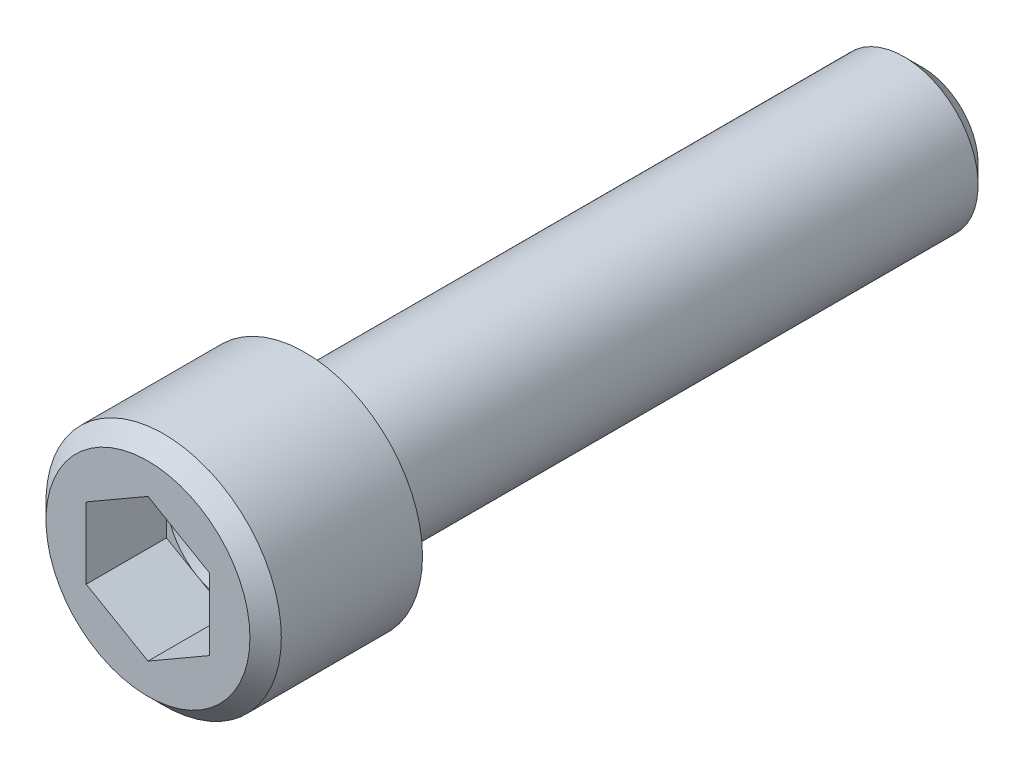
ISO-10303-21;
HEADER;
FILE_DESCRIPTION(('STEP AP214'),'2;1');
FILE_NAME('part.step','',(''),(''),'','','');
FILE_SCHEMA(('AUTOMOTIVE_DESIGN { 1 0 10303 214 1 1 1 1 }'));
ENDSEC;
DATA;
#1=APPLICATION_CONTEXT('core data for automotive mechanical design processes');
#2=APPLICATION_PROTOCOL_DEFINITION('international standard','automotive_design',2000,#1);
#3=PRODUCT_CONTEXT('',#1,'mechanical');
#4=PRODUCT('Part','Part','',(#3));
#5=PRODUCT_RELATED_PRODUCT_CATEGORY('part','',(#4));
#6=PRODUCT_DEFINITION_FORMATION('','',#4);
#7=PRODUCT_DEFINITION_CONTEXT('part definition',#1,'design');
#8=PRODUCT_DEFINITION('design','',#6,#7);
#9=PRODUCT_DEFINITION_SHAPE('','',#8);
#10=(LENGTH_UNIT() NAMED_UNIT(*) SI_UNIT(.MILLI.,.METRE.));
#11=(NAMED_UNIT(*) PLANE_ANGLE_UNIT() SI_UNIT($,.RADIAN.));
#12=(NAMED_UNIT(*) SI_UNIT($,.STERADIAN.) SOLID_ANGLE_UNIT());
#13=UNCERTAINTY_MEASURE_WITH_UNIT(LENGTH_MEASURE(1.E-05),#10,'distance_accuracy_value','');
#14=(GEOMETRIC_REPRESENTATION_CONTEXT(3) GLOBAL_UNCERTAINTY_ASSIGNED_CONTEXT((#13)) GLOBAL_UNIT_ASSIGNED_CONTEXT((#10,
#11,#12)) REPRESENTATION_CONTEXT('',''));
#15=CARTESIAN_POINT('',(0.,0.,0.));
#16=DIRECTION('',(0.,0.,1.));
#17=DIRECTION('',(1.,0.,0.));
#18=AXIS2_PLACEMENT_3D('',#15,#16,#17);
#19=CARTESIAN_POINT('',(-10.,0.,6.2));
#20=DIRECTION('',(0.,0.,-1.));
#21=DIRECTION('',(-1.,0.,0.));
#22=AXIS2_PLACEMENT_3D('',#19,#20,#21);
#23=PLANE('',#22);
#24=DIRECTION('',(0.,-1.,0.));
#25=VECTOR('',#24,1.);
#26=CARTESIAN_POINT('',(-5.,2.88675134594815,6.2));
#27=LINE('',#26,#25);
#28=CARTESIAN_POINT('',(-5.,2.88675134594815,6.2));
#29=VERTEX_POINT('',#28);
#30=CARTESIAN_POINT('',(-5.,0.,6.2));
#31=VERTEX_POINT('',#30);
#32=EDGE_CURVE('E126',#29,#31,#27,.T.);
#33=ORIENTED_EDGE('',*,*,#32,.T.);
#34=CARTESIAN_POINT('',(0.,0.,6.2));
#35=DIRECTION('',(0.,0.,1.));
#36=DIRECTION('',(1.,0.,0.));
#37=AXIS2_PLACEMENT_3D('',#34,#35,#36);
#38=CIRCLE('',#37,5.);
#39=CARTESIAN_POINT('',(-2.5,4.33012701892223,6.2));
#40=VERTEX_POINT('',#39);
#41=EDGE_CURVE('E29',#40,#31,#38,.T.);
#42=ORIENTED_EDGE('',*,*,#41,.F.);
#43=DIRECTION('',(-0.866025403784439,-0.5,0.));
#44=VECTOR('',#43,1.);
#45=CARTESIAN_POINT('',(0.,5.77350269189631,6.2));
#46=LINE('',#45,#44);
#47=EDGE_CURVE('E120',#40,#29,#46,.T.);
#48=ORIENTED_EDGE('',*,*,#47,.T.);
#49=EDGE_LOOP('',(#33,#42,#48));
#50=FACE_BOUND('',#49,.T.);
#51=ADVANCED_FACE('F14',(#50),#23,.F.);
#52=CARTESIAN_POINT('',(0.,5.77350269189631,6.2));
#53=VERTEX_POINT('',#52);
#54=EDGE_CURVE('E108',#53,#40,#46,.T.);
#55=ORIENTED_EDGE('',*,*,#54,.T.);
#56=CARTESIAN_POINT('',(2.5,4.33012701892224,6.2));
#57=VERTEX_POINT('',#56);
#58=EDGE_CURVE('E94',#57,#40,#38,.T.);
#59=ORIENTED_EDGE('',*,*,#58,.F.);
#60=DIRECTION('',(-0.866025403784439,0.5,0.));
#61=VECTOR('',#60,1.);
#62=CARTESIAN_POINT('',(5.,2.88675134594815,6.2));
#63=LINE('',#62,#61);
#64=EDGE_CURVE('E105',#57,#53,#63,.T.);
#65=ORIENTED_EDGE('',*,*,#64,.T.);
#66=EDGE_LOOP('',(#55,#59,#65));
#67=FACE_BOUND('',#66,.T.);
#68=ADVANCED_FACE('F104',(#67),#23,.F.);
#69=CARTESIAN_POINT('',(5.,2.88675134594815,6.2));
#70=VERTEX_POINT('',#69);
#71=EDGE_CURVE('E113',#70,#57,#63,.T.);
#72=ORIENTED_EDGE('',*,*,#71,.T.);
#73=CARTESIAN_POINT('',(5.,0.,6.2));
#74=VERTEX_POINT('',#73);
#75=EDGE_CURVE('E92',#74,#57,#38,.T.);
#76=ORIENTED_EDGE('',*,*,#75,.F.);
#77=DIRECTION('',(0.,1.,0.));
#78=VECTOR('',#77,1.);
#79=CARTESIAN_POINT('',(5.,-2.88675134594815,6.2));
#80=LINE('',#79,#78);
#81=EDGE_CURVE('E118',#74,#70,#80,.T.);
#82=ORIENTED_EDGE('',*,*,#81,.T.);
#83=EDGE_LOOP('',(#72,#76,#82));
#84=FACE_BOUND('',#83,.T.);
#85=ADVANCED_FACE('F117',(#84),#23,.F.);
#86=CARTESIAN_POINT('',(5.,-2.88675134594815,6.2));
#87=VERTEX_POINT('',#86);
#88=EDGE_CURVE('E115',#87,#74,#80,.T.);
#89=ORIENTED_EDGE('',*,*,#88,.T.);
#90=CARTESIAN_POINT('',(2.5,-4.33012701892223,6.2));
#91=VERTEX_POINT('',#90);
#92=EDGE_CURVE('E96',#91,#74,#38,.T.);
#93=ORIENTED_EDGE('',*,*,#92,.F.);
#94=DIRECTION('',(0.866025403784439,0.5,0.));
#95=VECTOR('',#94,1.);
#96=CARTESIAN_POINT('',(0.,-5.77350269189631,6.2));
#97=LINE('',#96,#95);
#98=EDGE_CURVE('E368',#91,#87,#97,.T.);
#99=ORIENTED_EDGE('',*,*,#98,.T.);
#100=EDGE_LOOP('',(#89,#93,#99));
#101=FACE_BOUND('',#100,.T.);
#102=ADVANCED_FACE('F274',(#101),#23,.F.);
#103=CARTESIAN_POINT('',(0.,-5.77350269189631,6.2));
#104=VERTEX_POINT('',#103);
#105=EDGE_CURVE('E369',#104,#91,#97,.T.);
#106=ORIENTED_EDGE('',*,*,#105,.T.);
#107=CARTESIAN_POINT('',(-2.5,-4.33012701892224,6.2));
#108=VERTEX_POINT('',#107);
#109=EDGE_CURVE('E382',#108,#91,#38,.T.);
#110=ORIENTED_EDGE('',*,*,#109,.F.);
#111=DIRECTION('',(0.866025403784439,-0.5,0.));
#112=VECTOR('',#111,1.);
#113=CARTESIAN_POINT('',(-5.,-2.88675134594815,6.2));
#114=LINE('',#113,#112);
#115=EDGE_CURVE('E365',#108,#104,#114,.T.);
#116=ORIENTED_EDGE('',*,*,#115,.T.);
#117=EDGE_LOOP('',(#106,#110,#116));
#118=FACE_BOUND('',#117,.T.);
#119=ADVANCED_FACE('F170',(#118),#23,.F.);
#120=CARTESIAN_POINT('',(0.,9.525,0.));
#121=DIRECTION('',(0.,0.,-1.));
#122=DIRECTION('',(-1.,0.,0.));
#123=AXIS2_PLACEMENT_3D('',#120,#121,#122);
#124=PLANE('',#123);
#125=CARTESIAN_POINT('',(0.,0.,0.));
#126=DIRECTION('',(0.,0.,1.));
#127=DIRECTION('',(1.,0.,0.));
#128=AXIS2_PLACEMENT_3D('',#125,#126,#127);
#129=CIRCLE('',#128,9.525);
#130=CARTESIAN_POINT('',(9.525,0.,0.));
#131=VERTEX_POINT('',#130);
#132=EDGE_CURVE('E143',#131,#131,#129,.T.);
#133=ORIENTED_EDGE('',*,*,#132,.F.);
#134=EDGE_LOOP('',(#133));
#135=FACE_BOUND('',#134,.T.);
#136=CARTESIAN_POINT('',(0.,0.,0.));
#137=DIRECTION('',(0.,0.,-1.));
#138=DIRECTION('',(-1.,0.,0.));
#139=AXIS2_PLACEMENT_3D('',#136,#137,#138);
#140=CIRCLE('',#139,6.);
#141=CARTESIAN_POINT('',(-6.,0.,0.));
#142=VERTEX_POINT('',#141);
#143=EDGE_CURVE('E132',#142,#142,#140,.T.);
#144=ORIENTED_EDGE('',*,*,#143,.F.);
#145=EDGE_LOOP('',(#144));
#146=FACE_BOUND('',#145,.T.);
#147=ADVANCED_FACE('F287',(#135,#146),#124,.T.);
#148=CARTESIAN_POINT('',(0.,0.,12.7));
#149=DIRECTION('',(0.,0.,1.));
#150=DIRECTION('',(1.,0.,0.));
#151=AXIS2_PLACEMENT_3D('',#148,#149,#150);
#152=PLANE('',#151);
#153=DIRECTION('',(0.866025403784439,-0.5,0.));
#154=VECTOR('',#153,1.);
#155=CARTESIAN_POINT('',(-5.,-2.88675134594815,12.7));
#156=LINE('',#155,#154);
#157=CARTESIAN_POINT('',(-5.,-2.88675134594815,12.7));
#158=VERTEX_POINT('',#157);
#159=CARTESIAN_POINT('',(0.,-5.77350269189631,12.7));
#160=VERTEX_POINT('',#159);
#161=EDGE_CURVE('E37',#158,#160,#156,.T.);
#162=ORIENTED_EDGE('',*,*,#161,.F.);
#163=DIRECTION('',(0.,-1.,0.));
#164=VECTOR('',#163,1.);
#165=CARTESIAN_POINT('',(-5.,2.88675134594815,12.7));
#166=LINE('',#165,#164);
#167=CARTESIAN_POINT('',(-5.,2.88675134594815,12.7));
#168=VERTEX_POINT('',#167);
#169=EDGE_CURVE('E349',#168,#158,#166,.T.);
#170=ORIENTED_EDGE('',*,*,#169,.F.);
#171=DIRECTION('',(-0.866025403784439,-0.5,0.));
#172=VECTOR('',#171,1.);
#173=CARTESIAN_POINT('',(0.,5.77350269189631,12.7));
#174=LINE('',#173,#172);
#175=CARTESIAN_POINT('',(0.,5.77350269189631,12.7));
#176=VERTEX_POINT('',#175);
#177=EDGE_CURVE('E361',#176,#168,#174,.T.);
#178=ORIENTED_EDGE('',*,*,#177,.F.);
#179=DIRECTION('',(-0.866025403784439,0.5,0.));
#180=VECTOR('',#179,1.);
#181=CARTESIAN_POINT('',(5.,2.88675134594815,12.7));
#182=LINE('',#181,#180);
#183=CARTESIAN_POINT('',(5.,2.88675134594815,12.7));
#184=VERTEX_POINT('',#183);
#185=EDGE_CURVE('E359',#184,#176,#182,.T.);
#186=ORIENTED_EDGE('',*,*,#185,.F.);
#187=DIRECTION('',(0.,1.,0.));
#188=VECTOR('',#187,1.);
#189=CARTESIAN_POINT('',(5.,-2.88675134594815,12.7));
#190=LINE('',#189,#188);
#191=CARTESIAN_POINT('',(5.,-2.88675134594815,12.7));
#192=VERTEX_POINT('',#191);
#193=EDGE_CURVE('E354',#192,#184,#190,.T.);
#194=ORIENTED_EDGE('',*,*,#193,.F.);
#195=DIRECTION('',(0.866025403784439,0.5,0.));
#196=VECTOR('',#195,1.);
#197=CARTESIAN_POINT('',(0.,-5.77350269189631,12.7));
#198=LINE('',#197,#196);
#199=EDGE_CURVE('E352',#160,#192,#198,.T.);
#200=ORIENTED_EDGE('',*,*,#199,.F.);
#201=EDGE_LOOP('',(#162,#170,#178,#186,#194,#200));
#202=FACE_BOUND('',#201,.T.);
#203=CARTESIAN_POINT('',(0.,0.,12.7));
#204=DIRECTION('',(0.,0.,1.));
#205=DIRECTION('',(1.,0.,0.));
#206=AXIS2_PLACEMENT_3D('',#203,#204,#205);
#207=CIRCLE('',#206,8.255);
#208=CARTESIAN_POINT('',(8.255,0.,12.7));
#209=VERTEX_POINT('',#208);
#210=EDGE_CURVE('E149',#209,#209,#207,.T.);
#211=ORIENTED_EDGE('',*,*,#210,.T.);
#212=EDGE_LOOP('',(#211));
#213=FACE_BOUND('',#212,.T.);
#214=ADVANCED_FACE('F16',(#202,#213),#152,.T.);
#215=CARTESIAN_POINT('',(0.,0.,12.7));
#216=DIRECTION('',(0.,0.,-1.));
#217=DIRECTION('',(-1.,0.,0.));
#218=AXIS2_PLACEMENT_3D('',#215,#216,#217);
#219=CONICAL_SURFACE('',#218,8.255,0.78539816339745);
#220=CARTESIAN_POINT('',(0.,0.,11.43));
#221=DIRECTION('',(0.,0.,1.));
#222=DIRECTION('',(1.,0.,0.));
#223=AXIS2_PLACEMENT_3D('',#220,#221,#222);
#224=CIRCLE('',#223,9.525);
#225=CARTESIAN_POINT('',(9.525,0.,11.43));
#226=VERTEX_POINT('',#225);
#227=EDGE_CURVE('E146',#226,#226,#224,.T.);
#228=ORIENTED_EDGE('',*,*,#227,.T.);
#229=EDGE_LOOP('',(#228));
#230=FACE_BOUND('',#229,.T.);
#231=ORIENTED_EDGE('',*,*,#210,.F.);
#232=EDGE_LOOP('',(#231));
#233=FACE_BOUND('',#232,.T.);
#234=ADVANCED_FACE('F303',(#230,#233),#219,.T.);
#235=CARTESIAN_POINT('',(0.,0.,44.45));
#236=DIRECTION('',(0.,0.,1.));
#237=DIRECTION('',(1.,0.,0.));
#238=AXIS2_PLACEMENT_3D('',#235,#236,#237);
#239=CYLINDRICAL_SURFACE('',#238,9.525);
#240=ORIENTED_EDGE('',*,*,#132,.T.);
#241=EDGE_LOOP('',(#240));
#242=FACE_BOUND('',#241,.T.);
#243=ORIENTED_EDGE('',*,*,#227,.F.);
#244=EDGE_LOOP('',(#243));
#245=FACE_BOUND('',#244,.T.);
#246=ADVANCED_FACE('F311',(#242,#245),#239,.T.);
#247=CARTESIAN_POINT('',(0.,0.,-50.));
#248=DIRECTION('',(0.,0.,1.));
#249=DIRECTION('',(1.,0.,0.));
#250=AXIS2_PLACEMENT_3D('',#247,#248,#249);
#251=CYLINDRICAL_SURFACE('',#250,6.);
#252=CARTESIAN_POINT('',(0.,0.,-48.5));
#253=DIRECTION('',(0.,0.,-1.));
#254=DIRECTION('',(-1.,0.,0.));
#255=AXIS2_PLACEMENT_3D('',#252,#253,#254);
#256=CIRCLE('',#255,6.);
#257=CARTESIAN_POINT('',(-6.,0.,-48.5));
#258=VERTEX_POINT('',#257);
#259=EDGE_CURVE('E9',#258,#258,#256,.F.);
#260=ORIENTED_EDGE('',*,*,#259,.T.);
#261=EDGE_LOOP('',(#260));
#262=FACE_BOUND('',#261,.T.);
#263=ORIENTED_EDGE('',*,*,#143,.T.);
#264=EDGE_LOOP('',(#263));
#265=FACE_BOUND('',#264,.T.);
#266=ADVANCED_FACE('F171',(#262,#265),#251,.T.);
#267=CARTESIAN_POINT('',(0.,0.,-50.));
#268=DIRECTION('',(0.,0.,-1.));
#269=DIRECTION('',(-1.,0.,0.));
#270=AXIS2_PLACEMENT_3D('',#267,#268,#269);
#271=PLANE('',#270);
#272=CARTESIAN_POINT('',(0.,0.,-50.));
#273=DIRECTION('',(0.,0.,-1.));
#274=DIRECTION('',(-1.,0.,0.));
#275=AXIS2_PLACEMENT_3D('',#272,#273,#274);
#276=CIRCLE('',#275,4.5);
#277=CARTESIAN_POINT('',(-4.5,0.,-50.));
#278=VERTEX_POINT('',#277);
#279=EDGE_CURVE('E22',#278,#278,#276,.T.);
#280=ORIENTED_EDGE('',*,*,#279,.T.);
#281=EDGE_LOOP('',(#280));
#282=FACE_BOUND('',#281,.T.);
#283=ADVANCED_FACE('F154',(#282),#271,.T.);
#284=CARTESIAN_POINT('',(0.,0.,-50.));
#285=DIRECTION('',(0.,0.,1.));
#286=DIRECTION('',(1.,0.,0.));
#287=AXIS2_PLACEMENT_3D('',#284,#285,#286);
#288=CONICAL_SURFACE('',#287,4.5,0.785398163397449);
#289=ORIENTED_EDGE('',*,*,#259,.F.);
#290=EDGE_LOOP('',(#289));
#291=FACE_BOUND('',#290,.T.);
#292=ORIENTED_EDGE('',*,*,#279,.F.);
#293=EDGE_LOOP('',(#292));
#294=FACE_BOUND('',#293,.T.);
#295=ADVANCED_FACE('F156',(#291,#294),#288,.T.);
#296=CARTESIAN_POINT('',(-5.,-2.88675134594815,6.2));
#297=VERTEX_POINT('',#296);
#298=EDGE_CURVE('E366',#297,#108,#114,.T.);
#299=ORIENTED_EDGE('',*,*,#298,.T.);
#300=EDGE_CURVE('E381',#31,#108,#38,.T.);
#301=ORIENTED_EDGE('',*,*,#300,.F.);
#302=EDGE_CURVE('E125',#31,#297,#27,.T.);
#303=ORIENTED_EDGE('',*,*,#302,.T.);
#304=EDGE_LOOP('',(#299,#301,#303));
#305=FACE_BOUND('',#304,.T.);
#306=ADVANCED_FACE('F158',(#305),#23,.F.);
#307=CARTESIAN_POINT('',(-5.,-2.88675134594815,6.2));
#308=DIRECTION('',(-0.5,-0.866025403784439,0.));
#309=DIRECTION('',(-0.866025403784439,0.5,0.));
#310=AXIS2_PLACEMENT_3D('',#307,#308,#309);
#311=PLANE('',#310);
#312=ORIENTED_EDGE('',*,*,#161,.T.);
#313=DIRECTION('',(0.,0.,1.));
#314=VECTOR('',#313,1.);
#315=CARTESIAN_POINT('',(0.,-5.77350269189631,6.2));
#316=LINE('',#315,#314);
#317=EDGE_CURVE('E129',#104,#160,#316,.T.);
#318=ORIENTED_EDGE('',*,*,#317,.F.);
#319=ORIENTED_EDGE('',*,*,#115,.F.);
#320=ORIENTED_EDGE('',*,*,#298,.F.);
#321=DIRECTION('',(0.,0.,1.));
#322=VECTOR('',#321,1.);
#323=CARTESIAN_POINT('',(-5.,-2.88675134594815,6.2));
#324=LINE('',#323,#322);
#325=EDGE_CURVE('E130',#297,#158,#324,.T.);
#326=ORIENTED_EDGE('',*,*,#325,.T.);
#327=EDGE_LOOP('',(#312,#318,#319,#320,#326));
#328=FACE_BOUND('',#327,.T.);
#329=ADVANCED_FACE('F167',(#328),#311,.F.);
#330=CARTESIAN_POINT('',(-5.,2.88675134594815,6.2));
#331=DIRECTION('',(-1.,0.,0.));
#332=DIRECTION('',(0.,0.,1.));
#333=AXIS2_PLACEMENT_3D('',#330,#331,#332);
#334=PLANE('',#333);
#335=ORIENTED_EDGE('',*,*,#169,.T.);
#336=ORIENTED_EDGE('',*,*,#325,.F.);
#337=ORIENTED_EDGE('',*,*,#302,.F.);
#338=ORIENTED_EDGE('',*,*,#32,.F.);
#339=DIRECTION('',(0.,0.,1.));
#340=VECTOR('',#339,1.);
#341=CARTESIAN_POINT('',(-5.,2.88675134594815,6.2));
#342=LINE('',#341,#340);
#343=EDGE_CURVE('E133',#29,#168,#342,.T.);
#344=ORIENTED_EDGE('',*,*,#343,.T.);
#345=EDGE_LOOP('',(#335,#336,#337,#338,#344));
#346=FACE_BOUND('',#345,.T.);
#347=ADVANCED_FACE('F182',(#346),#334,.F.);
#348=CARTESIAN_POINT('',(0.,5.77350269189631,6.2));
#349=DIRECTION('',(-0.5,0.866025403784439,0.));
#350=DIRECTION('',(0.866025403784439,0.5,0.));
#351=AXIS2_PLACEMENT_3D('',#348,#349,#350);
#352=PLANE('',#351);
#353=ORIENTED_EDGE('',*,*,#177,.T.);
#354=ORIENTED_EDGE('',*,*,#343,.F.);
#355=ORIENTED_EDGE('',*,*,#47,.F.);
#356=ORIENTED_EDGE('',*,*,#54,.F.);
#357=DIRECTION('',(0.,0.,1.));
#358=VECTOR('',#357,1.);
#359=CARTESIAN_POINT('',(0.,5.77350269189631,6.2));
#360=LINE('',#359,#358);
#361=EDGE_CURVE('E114',#53,#176,#360,.T.);
#362=ORIENTED_EDGE('',*,*,#361,.T.);
#363=EDGE_LOOP('',(#353,#354,#355,#356,#362));
#364=FACE_BOUND('',#363,.T.);
#365=ADVANCED_FACE('F185',(#364),#352,.F.);
#366=CARTESIAN_POINT('',(5.,2.88675134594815,6.2));
#367=DIRECTION('',(0.5,0.866025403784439,0.));
#368=DIRECTION('',(0.866025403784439,-0.5,0.));
#369=AXIS2_PLACEMENT_3D('',#366,#367,#368);
#370=PLANE('',#369);
#371=ORIENTED_EDGE('',*,*,#185,.T.);
#372=ORIENTED_EDGE('',*,*,#361,.F.);
#373=ORIENTED_EDGE('',*,*,#64,.F.);
#374=ORIENTED_EDGE('',*,*,#71,.F.);
#375=DIRECTION('',(0.,0.,1.));
#376=VECTOR('',#375,1.);
#377=CARTESIAN_POINT('',(5.,2.88675134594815,6.2));
#378=LINE('',#377,#376);
#379=EDGE_CURVE('E136',#70,#184,#378,.T.);
#380=ORIENTED_EDGE('',*,*,#379,.T.);
#381=EDGE_LOOP('',(#371,#372,#373,#374,#380));
#382=FACE_BOUND('',#381,.T.);
#383=ADVANCED_FACE('F112',(#382),#370,.F.);
#384=CARTESIAN_POINT('',(5.,-2.88675134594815,6.2));
#385=DIRECTION('',(1.,0.,0.));
#386=DIRECTION('',(0.,-1.,0.));
#387=AXIS2_PLACEMENT_3D('',#384,#385,#386);
#388=PLANE('',#387);
#389=ORIENTED_EDGE('',*,*,#193,.T.);
#390=ORIENTED_EDGE('',*,*,#379,.F.);
#391=ORIENTED_EDGE('',*,*,#81,.F.);
#392=ORIENTED_EDGE('',*,*,#88,.F.);
#393=DIRECTION('',(0.,0.,1.));
#394=VECTOR('',#393,1.);
#395=CARTESIAN_POINT('',(5.,-2.88675134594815,6.2));
#396=LINE('',#395,#394);
#397=EDGE_CURVE('E138',#87,#192,#396,.T.);
#398=ORIENTED_EDGE('',*,*,#397,.T.);
#399=EDGE_LOOP('',(#389,#390,#391,#392,#398));
#400=FACE_BOUND('',#399,.T.);
#401=ADVANCED_FACE('F192',(#400),#388,.F.);
#402=CARTESIAN_POINT('',(0.,-5.77350269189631,6.2));
#403=DIRECTION('',(0.5,-0.866025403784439,0.));
#404=DIRECTION('',(-0.866025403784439,-0.5,0.));
#405=AXIS2_PLACEMENT_3D('',#402,#403,#404);
#406=PLANE('',#405);
#407=ORIENTED_EDGE('',*,*,#199,.T.);
#408=ORIENTED_EDGE('',*,*,#397,.F.);
#409=ORIENTED_EDGE('',*,*,#98,.F.);
#410=ORIENTED_EDGE('',*,*,#105,.F.);
#411=ORIENTED_EDGE('',*,*,#317,.T.);
#412=EDGE_LOOP('',(#407,#408,#409,#410,#411));
#413=FACE_BOUND('',#412,.T.);
#414=ADVANCED_FACE('F89',(#413),#406,.F.);
#415=CARTESIAN_POINT('',(0.,0.,6.2));
#416=DIRECTION('',(0.,0.,1.));
#417=DIRECTION('',(1.,0.,0.));
#418=AXIS2_PLACEMENT_3D('',#415,#416,#417);
#419=CONICAL_SURFACE('',#418,5.,1.0471975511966);
#420=CARTESIAN_POINT('',(0.,0.,3.31324865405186));
#421=VERTEX_POINT('',#420);
#422=VERTEX_LOOP('',#421);
#423=FACE_BOUND('',#422,.T.);
#424=ORIENTED_EDGE('',*,*,#75,.T.);
#425=ORIENTED_EDGE('',*,*,#58,.T.);
#426=ORIENTED_EDGE('',*,*,#41,.T.);
#427=ORIENTED_EDGE('',*,*,#300,.T.);
#428=ORIENTED_EDGE('',*,*,#109,.T.);
#429=ORIENTED_EDGE('',*,*,#92,.T.);
#430=EDGE_LOOP('',(#424,#425,#426,#427,#428,#429));
#431=FACE_BOUND('',#430,.T.);
#432=ADVANCED_FACE('F87',(#423,#431),#419,.F.);
#433=CLOSED_SHELL('',(#51,#68,#85,#102,#119,#147,#214,#234,#246,#266,#283,#295,#306,#329,#347,
#365,#383,#401,#414,#432));
#434=MANIFOLD_SOLID_BREP('B1',#433);
#435=ADVANCED_BREP_SHAPE_REPRESENTATION('',(#18,#434),#14);
#436=SHAPE_DEFINITION_REPRESENTATION(#9,#435);
ENDSEC;
END-ISO-10303-21;
